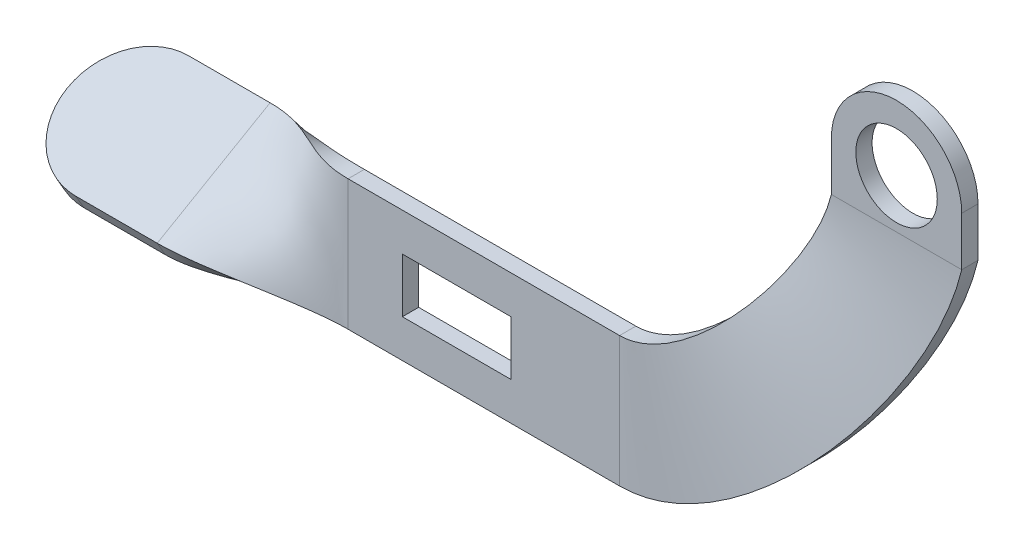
ISO-10303-21;
HEADER;
FILE_DESCRIPTION(('STEP AP214'),'2;1');
FILE_NAME('part.step','',(''),(''),'','','');
FILE_SCHEMA(('AUTOMOTIVE_DESIGN { 1 0 10303 214 1 1 1 1 }'));
ENDSEC;
DATA;
#1=APPLICATION_CONTEXT('core data for automotive mechanical design processes');
#2=APPLICATION_PROTOCOL_DEFINITION('international standard','automotive_design',2000,#1);
#3=PRODUCT_CONTEXT('',#1,'mechanical');
#4=PRODUCT('Part','Part','',(#3));
#5=PRODUCT_RELATED_PRODUCT_CATEGORY('part','',(#4));
#6=PRODUCT_DEFINITION_FORMATION('','',#4);
#7=PRODUCT_DEFINITION_CONTEXT('part definition',#1,'design');
#8=PRODUCT_DEFINITION('design','',#6,#7);
#9=PRODUCT_DEFINITION_SHAPE('','',#8);
#10=(LENGTH_UNIT() NAMED_UNIT(*) SI_UNIT(.MILLI.,.METRE.));
#11=(NAMED_UNIT(*) PLANE_ANGLE_UNIT() SI_UNIT($,.RADIAN.));
#12=(NAMED_UNIT(*) SI_UNIT($,.STERADIAN.) SOLID_ANGLE_UNIT());
#13=UNCERTAINTY_MEASURE_WITH_UNIT(LENGTH_MEASURE(1.E-05),#10,'distance_accuracy_value','');
#14=(GEOMETRIC_REPRESENTATION_CONTEXT(3) GLOBAL_UNCERTAINTY_ASSIGNED_CONTEXT((#13)) GLOBAL_UNIT_ASSIGNED_CONTEXT((#10,
#11,#12)) REPRESENTATION_CONTEXT('',''));
#15=CARTESIAN_POINT('',(0.,0.,0.));
#16=DIRECTION('',(0.,0.,1.));
#17=DIRECTION('',(1.,0.,0.));
#18=AXIS2_PLACEMENT_3D('',#15,#16,#17);
#19=CARTESIAN_POINT('',(0.,24.,3.));
#20=DIRECTION('',(0.,0.,-1.));
#21=DIRECTION('',(-1.,0.,0.));
#22=AXIS2_PLACEMENT_3D('',#19,#20,#21);
#23=PLANE('',#22);
#24=DIRECTION('',(0.,-1.,0.));
#25=VECTOR('',#24,1.);
#26=CARTESIAN_POINT('',(0.,0.,3.));
#27=LINE('',#26,#25);
#28=CARTESIAN_POINT('',(0.,24.,3.));
#29=VERTEX_POINT('',#28);
#30=CARTESIAN_POINT('',(0.,0.,3.));
#31=VERTEX_POINT('',#30);
#32=EDGE_CURVE('E292',#29,#31,#27,.T.);
#33=ORIENTED_EDGE('',*,*,#32,.T.);
#34=DIRECTION('',(1.,0.,0.));
#35=VECTOR('',#34,1.);
#36=CARTESIAN_POINT('',(0.,0.,3.));
#37=LINE('',#36,#35);
#38=CARTESIAN_POINT('',(50.,0.,3.));
#39=VERTEX_POINT('',#38);
#40=EDGE_CURVE('E420',#31,#39,#37,.T.);
#41=ORIENTED_EDGE('',*,*,#40,.T.);
#42=DIRECTION('',(0.,1.,0.));
#43=VECTOR('',#42,1.);
#44=CARTESIAN_POINT('',(50.,0.,3.));
#45=LINE('',#44,#43);
#46=CARTESIAN_POINT('',(50.,24.,3.));
#47=VERTEX_POINT('',#46);
#48=EDGE_CURVE('E423',#39,#47,#45,.T.);
#49=ORIENTED_EDGE('',*,*,#48,.T.);
#50=DIRECTION('',(-1.,0.,0.));
#51=VECTOR('',#50,1.);
#52=CARTESIAN_POINT('',(0.,24.,3.));
#53=LINE('',#52,#51);
#54=EDGE_CURVE('E425',#47,#29,#53,.T.);
#55=ORIENTED_EDGE('',*,*,#54,.T.);
#56=EDGE_LOOP('',(#33,#41,#49,#55));
#57=FACE_BOUND('',#56,.T.);
#58=DIRECTION('',(0.,-1.,0.));
#59=VECTOR('',#58,1.);
#60=CARTESIAN_POINT('',(10.,17.,3.));
#61=LINE('',#60,#59);
#62=CARTESIAN_POINT('',(10.,17.,3.));
#63=VERTEX_POINT('',#62);
#64=CARTESIAN_POINT('',(10.,7.,3.));
#65=VERTEX_POINT('',#64);
#66=EDGE_CURVE('E393',#63,#65,#61,.T.);
#67=ORIENTED_EDGE('',*,*,#66,.F.);
#68=DIRECTION('',(-1.,0.,0.));
#69=VECTOR('',#68,1.);
#70=CARTESIAN_POINT('',(10.,17.,3.));
#71=LINE('',#70,#69);
#72=CARTESIAN_POINT('',(30.,17.,3.));
#73=VERTEX_POINT('',#72);
#74=EDGE_CURVE('E400',#73,#63,#71,.T.);
#75=ORIENTED_EDGE('',*,*,#74,.F.);
#76=DIRECTION('',(0.,1.,0.));
#77=VECTOR('',#76,1.);
#78=CARTESIAN_POINT('',(30.,17.,3.));
#79=LINE('',#78,#77);
#80=CARTESIAN_POINT('',(30.,7.,3.));
#81=VERTEX_POINT('',#80);
#82=EDGE_CURVE('E398',#81,#73,#79,.T.);
#83=ORIENTED_EDGE('',*,*,#82,.F.);
#84=DIRECTION('',(1.,0.,0.));
#85=VECTOR('',#84,1.);
#86=CARTESIAN_POINT('',(10.,7.,3.));
#87=LINE('',#86,#85);
#88=EDGE_CURVE('E395',#65,#81,#87,.T.);
#89=ORIENTED_EDGE('',*,*,#88,.F.);
#90=EDGE_LOOP('',(#67,#75,#83,#89));
#91=FACE_BOUND('',#90,.T.);
#92=ADVANCED_FACE('F139',(#57,#91),#23,.F.);
#93=CARTESIAN_POINT('',(0.,24.,0.));
#94=DIRECTION('',(0.,0.,-1.));
#95=DIRECTION('',(-1.,0.,0.));
#96=AXIS2_PLACEMENT_3D('',#93,#94,#95);
#97=PLANE('',#96);
#98=DIRECTION('',(0.,-1.,0.));
#99=VECTOR('',#98,1.);
#100=CARTESIAN_POINT('',(0.,0.,0.));
#101=LINE('',#100,#99);
#102=CARTESIAN_POINT('',(0.,24.,0.));
#103=VERTEX_POINT('',#102);
#104=CARTESIAN_POINT('',(0.,0.,0.));
#105=VERTEX_POINT('',#104);
#106=EDGE_CURVE('E418',#103,#105,#101,.T.);
#107=ORIENTED_EDGE('',*,*,#106,.F.);
#108=DIRECTION('',(-1.,0.,0.));
#109=VECTOR('',#108,1.);
#110=CARTESIAN_POINT('',(0.,24.,0.));
#111=LINE('',#110,#109);
#112=CARTESIAN_POINT('',(50.,24.,0.));
#113=VERTEX_POINT('',#112);
#114=EDGE_CURVE('E421',#113,#103,#111,.T.);
#115=ORIENTED_EDGE('',*,*,#114,.F.);
#116=DIRECTION('',(0.,1.,0.));
#117=VECTOR('',#116,1.);
#118=CARTESIAN_POINT('',(50.,0.,0.));
#119=LINE('',#118,#117);
#120=CARTESIAN_POINT('',(50.,0.,0.));
#121=VERTEX_POINT('',#120);
#122=EDGE_CURVE('E433',#121,#113,#119,.T.);
#123=ORIENTED_EDGE('',*,*,#122,.F.);
#124=DIRECTION('',(1.,0.,0.));
#125=VECTOR('',#124,1.);
#126=CARTESIAN_POINT('',(0.,0.,0.));
#127=LINE('',#126,#125);
#128=EDGE_CURVE('E430',#105,#121,#127,.T.);
#129=ORIENTED_EDGE('',*,*,#128,.F.);
#130=EDGE_LOOP('',(#107,#115,#123,#129));
#131=FACE_BOUND('',#130,.T.);
#132=DIRECTION('',(-1.,0.,0.));
#133=VECTOR('',#132,1.);
#134=CARTESIAN_POINT('',(10.,17.,0.));
#135=LINE('',#134,#133);
#136=CARTESIAN_POINT('',(30.,17.,0.));
#137=VERTEX_POINT('',#136);
#138=CARTESIAN_POINT('',(10.,17.,0.));
#139=VERTEX_POINT('',#138);
#140=EDGE_CURVE('E396',#137,#139,#135,.T.);
#141=ORIENTED_EDGE('',*,*,#140,.T.);
#142=DIRECTION('',(0.,-1.,0.));
#143=VECTOR('',#142,1.);
#144=CARTESIAN_POINT('',(10.,17.,0.));
#145=LINE('',#144,#143);
#146=CARTESIAN_POINT('',(10.,7.,0.));
#147=VERTEX_POINT('',#146);
#148=EDGE_CURVE('E162',#139,#147,#145,.T.);
#149=ORIENTED_EDGE('',*,*,#148,.T.);
#150=DIRECTION('',(1.,0.,0.));
#151=VECTOR('',#150,1.);
#152=CARTESIAN_POINT('',(10.,7.,0.));
#153=LINE('',#152,#151);
#154=CARTESIAN_POINT('',(30.,7.,0.));
#155=VERTEX_POINT('',#154);
#156=EDGE_CURVE('E404',#147,#155,#153,.T.);
#157=ORIENTED_EDGE('',*,*,#156,.T.);
#158=DIRECTION('',(0.,1.,0.));
#159=VECTOR('',#158,1.);
#160=CARTESIAN_POINT('',(30.,17.,0.));
#161=LINE('',#160,#159);
#162=EDGE_CURVE('E407',#155,#137,#161,.T.);
#163=ORIENTED_EDGE('',*,*,#162,.T.);
#164=EDGE_LOOP('',(#141,#149,#157,#163));
#165=FACE_BOUND('',#164,.T.);
#166=ADVANCED_FACE('F486',(#131,#165),#97,.T.);
#167=CARTESIAN_POINT('',(0.,0.,3.));
#168=DIRECTION('',(0.,1.,0.));
#169=DIRECTION('',(0.,0.,1.));
#170=AXIS2_PLACEMENT_3D('',#167,#168,#169);
#171=PLANE('',#170);
#172=ORIENTED_EDGE('',*,*,#128,.T.);
#173=DIRECTION('',(0.,0.,-1.));
#174=VECTOR('',#173,1.);
#175=CARTESIAN_POINT('',(50.,0.,3.));
#176=LINE('',#175,#174);
#177=EDGE_CURVE('E147',#39,#121,#176,.T.);
#178=ORIENTED_EDGE('',*,*,#177,.F.);
#179=ORIENTED_EDGE('',*,*,#40,.F.);
#180=DIRECTION('',(0.,0.,-1.));
#181=VECTOR('',#180,1.);
#182=CARTESIAN_POINT('',(0.,0.,3.));
#183=LINE('',#182,#181);
#184=EDGE_CURVE('E12',#31,#105,#183,.T.);
#185=ORIENTED_EDGE('',*,*,#184,.T.);
#186=EDGE_LOOP('',(#172,#178,#179,#185));
#187=FACE_BOUND('',#186,.T.);
#188=ADVANCED_FACE('F141',(#187),#171,.F.);
#189=CARTESIAN_POINT('',(0.,24.,3.));
#190=DIRECTION('',(0.,-1.,0.));
#191=DIRECTION('',(0.,0.,-1.));
#192=AXIS2_PLACEMENT_3D('',#189,#190,#191);
#193=PLANE('',#192);
#194=ORIENTED_EDGE('',*,*,#114,.T.);
#195=DIRECTION('',(0.,0.,-1.));
#196=VECTOR('',#195,1.);
#197=CARTESIAN_POINT('',(0.,24.,3.));
#198=LINE('',#197,#196);
#199=EDGE_CURVE('E427',#29,#103,#198,.T.);
#200=ORIENTED_EDGE('',*,*,#199,.F.);
#201=ORIENTED_EDGE('',*,*,#54,.F.);
#202=DIRECTION('',(0.,0.,-1.));
#203=VECTOR('',#202,1.);
#204=CARTESIAN_POINT('',(50.,24.,3.));
#205=LINE('',#204,#203);
#206=EDGE_CURVE('E439',#47,#113,#205,.T.);
#207=ORIENTED_EDGE('',*,*,#206,.T.);
#208=EDGE_LOOP('',(#194,#200,#201,#207));
#209=FACE_BOUND('',#208,.T.);
#210=ADVANCED_FACE('F498',(#209),#193,.F.);
#211=CARTESIAN_POINT('',(10.,17.,3.));
#212=DIRECTION('',(1.,0.,0.));
#213=DIRECTION('',(0.,0.,-1.));
#214=AXIS2_PLACEMENT_3D('',#211,#212,#213);
#215=PLANE('',#214);
#216=ORIENTED_EDGE('',*,*,#148,.F.);
#217=DIRECTION('',(0.,0.,-1.));
#218=VECTOR('',#217,1.);
#219=CARTESIAN_POINT('',(10.,17.,3.));
#220=LINE('',#219,#218);
#221=EDGE_CURVE('E402',#63,#139,#220,.T.);
#222=ORIENTED_EDGE('',*,*,#221,.F.);
#223=ORIENTED_EDGE('',*,*,#66,.T.);
#224=DIRECTION('',(0.,0.,-1.));
#225=VECTOR('',#224,1.);
#226=CARTESIAN_POINT('',(10.,7.,3.));
#227=LINE('',#226,#225);
#228=EDGE_CURVE('E416',#65,#147,#227,.T.);
#229=ORIENTED_EDGE('',*,*,#228,.T.);
#230=EDGE_LOOP('',(#216,#222,#223,#229));
#231=FACE_BOUND('',#230,.T.);
#232=ADVANCED_FACE('F496',(#231),#215,.T.);
#233=CARTESIAN_POINT('',(10.,7.,3.));
#234=DIRECTION('',(0.,1.,0.));
#235=DIRECTION('',(0.,0.,1.));
#236=AXIS2_PLACEMENT_3D('',#233,#234,#235);
#237=PLANE('',#236);
#238=ORIENTED_EDGE('',*,*,#156,.F.);
#239=ORIENTED_EDGE('',*,*,#228,.F.);
#240=ORIENTED_EDGE('',*,*,#88,.T.);
#241=DIRECTION('',(0.,0.,-1.));
#242=VECTOR('',#241,1.);
#243=CARTESIAN_POINT('',(30.,7.,3.));
#244=LINE('',#243,#242);
#245=EDGE_CURVE('E414',#81,#155,#244,.T.);
#246=ORIENTED_EDGE('',*,*,#245,.T.);
#247=EDGE_LOOP('',(#238,#239,#240,#246));
#248=FACE_BOUND('',#247,.T.);
#249=ADVANCED_FACE('F505',(#248),#237,.T.);
#250=CARTESIAN_POINT('',(30.,17.,3.));
#251=DIRECTION('',(-1.,0.,0.));
#252=DIRECTION('',(0.,0.,1.));
#253=AXIS2_PLACEMENT_3D('',#250,#251,#252);
#254=PLANE('',#253);
#255=ORIENTED_EDGE('',*,*,#162,.F.);
#256=ORIENTED_EDGE('',*,*,#245,.F.);
#257=ORIENTED_EDGE('',*,*,#82,.T.);
#258=DIRECTION('',(0.,0.,-1.));
#259=VECTOR('',#258,1.);
#260=CARTESIAN_POINT('',(30.,17.,3.));
#261=LINE('',#260,#259);
#262=EDGE_CURVE('E154',#73,#137,#261,.T.);
#263=ORIENTED_EDGE('',*,*,#262,.T.);
#264=EDGE_LOOP('',(#255,#256,#257,#263));
#265=FACE_BOUND('',#264,.T.);
#266=ADVANCED_FACE('F544',(#265),#254,.T.);
#267=CARTESIAN_POINT('',(10.,17.,3.));
#268=DIRECTION('',(0.,-1.,0.));
#269=DIRECTION('',(0.,0.,-1.));
#270=AXIS2_PLACEMENT_3D('',#267,#268,#269);
#271=PLANE('',#270);
#272=ORIENTED_EDGE('',*,*,#140,.F.);
#273=ORIENTED_EDGE('',*,*,#262,.F.);
#274=ORIENTED_EDGE('',*,*,#74,.T.);
#275=ORIENTED_EDGE('',*,*,#221,.T.);
#276=EDGE_LOOP('',(#272,#273,#274,#275));
#277=FACE_BOUND('',#276,.T.);
#278=ADVANCED_FACE('F535',(#277),#271,.T.);
#279=CARTESIAN_POINT('',(79.,56.,-10.));
#280=CARTESIAN_POINT('',(75.8125972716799,42.4651832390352,-10.));
#281=CARTESIAN_POINT('',(62.7323307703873,24.,0.));
#282=CARTESIAN_POINT('',(50.,24.,0.));
#283=CARTESIAN_POINT('',(81.,56.,-10.));
#284=CARTESIAN_POINT('',(77.6125411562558,41.615675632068,-10.));
#285=CARTESIAN_POINT('',(63.5510503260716,22.,0.));
#286=CARTESIAN_POINT('',(50.,22.,0.));
#287=CARTESIAN_POINT('',(85.0000000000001,56.,-10.));
#288=CARTESIAN_POINT('',(81.2124289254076,39.9166604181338,-10.));
#289=CARTESIAN_POINT('',(65.1884894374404,18.,0.));
#290=CARTESIAN_POINT('',(50.,18.,0.));
#291=CARTESIAN_POINT('',(90.9999999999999,56.,-9.99999999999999));
#292=CARTESIAN_POINT('',(86.6089116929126,37.3539170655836,-9.99999999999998));
#293=CARTESIAN_POINT('',(67.659257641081,12.,0.));
#294=CARTESIAN_POINT('',(50.,12.,0.));
#295=CARTESIAN_POINT('',(97.0000000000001,56.,-10.));
#296=CARTESIAN_POINT('',(92.0042255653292,34.7862101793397,-10.));
#297=CARTESIAN_POINT('',(70.135125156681,5.99999999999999,0.));
#298=CARTESIAN_POINT('',(50.,5.99999999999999,0.));
#299=CARTESIAN_POINT('',(101.,56.,-10.));
#300=CARTESIAN_POINT('',(95.6002466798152,33.0707758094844,-10.));
#301=CARTESIAN_POINT('',(71.7894325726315,2.,0.));
#302=CARTESIAN_POINT('',(50.,2.,0.));
#303=CARTESIAN_POINT('',(103.,56.,-10.));
#304=CARTESIAN_POINT('',(97.3982572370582,32.2130586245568,-10.));
#305=CARTESIAN_POINT('',(72.6165862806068,0.,0.));
#306=CARTESIAN_POINT('',(50.,0.,0.));
#307=B_SPLINE_SURFACE_WITH_KNOTS('',3,3,((#279,#280,#281,#282),(#283,#284,#285,#286),(#287,#288,
#289,#290),(#291,#292,#293,#294),(#295,#296,#297,#298),(#299,#300,#301,#302),(#303,#304,#305,
#306)),.UNSPECIFIED.,.F.,.F.,.F.,(4,1,1,1,4),(4,4),(0.,0.25,0.5,0.75,1.),(0.,1.),.UNSPECIFIED.);
#308=DIRECTION('',(1.,0.,0.));
#309=VECTOR('',#308,1.);
#310=CARTESIAN_POINT('',(90.9999999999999,56.,-9.99999999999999));
#311=LINE('',#310,#309);
#312=CARTESIAN_POINT('',(79.,56.,-10.));
#313=VERTEX_POINT('',#312);
#314=CARTESIAN_POINT('',(103.,56.,-10.));
#315=VERTEX_POINT('',#314);
#316=EDGE_CURVE('E363',#313,#315,#311,.T.);
#317=CARTESIAN_POINT('',(103.,56.,-10.));
#318=CARTESIAN_POINT('',(97.3982572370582,32.2130586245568,-10.));
#319=CARTESIAN_POINT('',(72.6165862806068,0.,0.));
#320=CARTESIAN_POINT('',(50.,0.,0.));
#321=B_SPLINE_CURVE_WITH_KNOTS('',3,(#317,#318,#319,#320),.UNSPECIFIED.,.F.,.F.,(4,4),(0.,1.),.UNSPECIFIED.);
#322=EDGE_CURVE('E355',#315,#121,#321,.T.);
#323=CARTESIAN_POINT('',(79.,56.,-10.));
#324=CARTESIAN_POINT('',(75.8125972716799,42.4651832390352,-10.));
#325=CARTESIAN_POINT('',(62.7323307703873,24.,0.));
#326=CARTESIAN_POINT('',(50.,24.,0.));
#327=B_SPLINE_CURVE_WITH_KNOTS('',3,(#323,#324,#325,#326),.UNSPECIFIED.,.F.,.F.,(4,4),(0.,1.),.UNSPECIFIED.);
#328=EDGE_CURVE('E349',#313,#113,#327,.T.);
#329=ORIENTED_EDGE('',*,*,#316,.T.);
#330=ORIENTED_EDGE('',*,*,#322,.T.);
#331=ORIENTED_EDGE('',*,*,#122,.T.);
#332=ORIENTED_EDGE('',*,*,#328,.F.);
#333=EDGE_LOOP('',(#329,#330,#331,#332));
#334=FACE_BOUND('',#333,.T.);
#335=ADVANCED_FACE('F449',(#334),#307,.T.);
#336=CARTESIAN_POINT('',(103.,56.,-10.));
#337=CARTESIAN_POINT('',(97.3982572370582,32.2130586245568,-10.));
#338=CARTESIAN_POINT('',(72.6165862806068,0.,0.));
#339=CARTESIAN_POINT('',(50.,0.,0.));
#340=CARTESIAN_POINT('',(103.,56.,-9.75));
#341=CARTESIAN_POINT('',(97.3982572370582,32.2130586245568,-9.75));
#342=CARTESIAN_POINT('',(72.6165862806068,0.,0.25));
#343=CARTESIAN_POINT('',(50.,0.,0.25));
#344=CARTESIAN_POINT('',(103.,56.,-9.25000000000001));
#345=CARTESIAN_POINT('',(97.3982572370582,32.2130586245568,-9.25000000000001));
#346=CARTESIAN_POINT('',(72.6165862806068,0.,0.749999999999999));
#347=CARTESIAN_POINT('',(50.,0.,0.75));
#348=CARTESIAN_POINT('',(103.,56.,-8.49999999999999));
#349=CARTESIAN_POINT('',(97.3982572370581,32.2130586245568,-8.49999999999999));
#350=CARTESIAN_POINT('',(72.6165862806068,0.,1.5));
#351=CARTESIAN_POINT('',(50.,0.,1.5));
#352=CARTESIAN_POINT('',(103.,56.,-7.75000000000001));
#353=CARTESIAN_POINT('',(97.3982572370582,32.2130586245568,-7.75000000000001));
#354=CARTESIAN_POINT('',(72.6165862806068,0.,2.25));
#355=CARTESIAN_POINT('',(50.,0.,2.25));
#356=CARTESIAN_POINT('',(103.,56.,-7.25));
#357=CARTESIAN_POINT('',(97.3982572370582,32.2130586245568,-7.25));
#358=CARTESIAN_POINT('',(72.6165862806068,0.,2.75));
#359=CARTESIAN_POINT('',(50.,0.,2.75));
#360=CARTESIAN_POINT('',(103.,56.,-7.));
#361=CARTESIAN_POINT('',(97.3982572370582,32.2130586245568,-7.));
#362=CARTESIAN_POINT('',(72.6165862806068,0.,3.));
#363=CARTESIAN_POINT('',(50.,0.,3.));
#364=B_SPLINE_SURFACE_WITH_KNOTS('',3,3,((#336,#337,#338,#339),(#340,#341,#342,#343),(#344,#345,
#346,#347),(#348,#349,#350,#351),(#352,#353,#354,#355),(#356,#357,#358,#359),(#360,#361,#362,
#363)),.UNSPECIFIED.,.F.,.F.,.F.,(4,1,1,1,4),(4,4),(0.,0.25,0.5,0.75,1.),(0.,1.),.UNSPECIFIED.);
#365=DIRECTION('',(0.,0.,1.));
#366=VECTOR('',#365,1.);
#367=CARTESIAN_POINT('',(103.,56.,-8.5));
#368=LINE('',#367,#366);
#369=CARTESIAN_POINT('',(103.,56.,-7.));
#370=VERTEX_POINT('',#369);
#371=EDGE_CURVE('E364',#315,#370,#368,.T.);
#372=CARTESIAN_POINT('',(103.,56.,-7.));
#373=CARTESIAN_POINT('',(97.3982572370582,32.2130586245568,-7.));
#374=CARTESIAN_POINT('',(72.6165862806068,0.,3.));
#375=CARTESIAN_POINT('',(50.,0.,3.));
#376=B_SPLINE_CURVE_WITH_KNOTS('',3,(#372,#373,#374,#375),.UNSPECIFIED.,.F.,.F.,(4,4),(0.,1.),.UNSPECIFIED.);
#377=EDGE_CURVE('E365',#370,#39,#376,.T.);
#378=ORIENTED_EDGE('',*,*,#371,.T.);
#379=ORIENTED_EDGE('',*,*,#377,.T.);
#380=ORIENTED_EDGE('',*,*,#177,.T.);
#381=ORIENTED_EDGE('',*,*,#322,.F.);
#382=EDGE_LOOP('',(#378,#379,#380,#381));
#383=FACE_BOUND('',#382,.T.);
#384=ADVANCED_FACE('F444',(#383),#364,.T.);
#385=CARTESIAN_POINT('',(103.,56.,-7.));
#386=CARTESIAN_POINT('',(97.3982572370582,32.2130586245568,-7.));
#387=CARTESIAN_POINT('',(72.6165862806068,0.,3.));
#388=CARTESIAN_POINT('',(50.,0.,3.));
#389=CARTESIAN_POINT('',(101.,56.,-7.));
#390=CARTESIAN_POINT('',(95.6002466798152,33.0707758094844,-7.));
#391=CARTESIAN_POINT('',(71.7894325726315,2.,3.));
#392=CARTESIAN_POINT('',(50.,2.,3.));
#393=CARTESIAN_POINT('',(97.0000000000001,56.,-7.));
#394=CARTESIAN_POINT('',(92.0042255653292,34.7862101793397,-7.));
#395=CARTESIAN_POINT('',(70.135125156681,6.,3.));
#396=CARTESIAN_POINT('',(50.,6.,3.));
#397=CARTESIAN_POINT('',(90.9999999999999,56.,-7.));
#398=CARTESIAN_POINT('',(86.6089116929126,37.3539170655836,-7.));
#399=CARTESIAN_POINT('',(67.659257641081,12.,3.));
#400=CARTESIAN_POINT('',(50.,12.,3.));
#401=CARTESIAN_POINT('',(85.,56.,-7.));
#402=CARTESIAN_POINT('',(81.2124289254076,39.9166604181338,-7.));
#403=CARTESIAN_POINT('',(65.1884894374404,18.,3.));
#404=CARTESIAN_POINT('',(50.,18.,3.));
#405=CARTESIAN_POINT('',(81.,56.,-7.));
#406=CARTESIAN_POINT('',(77.6125411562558,41.615675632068,-7.));
#407=CARTESIAN_POINT('',(63.5510503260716,22.,3.));
#408=CARTESIAN_POINT('',(50.,22.,3.));
#409=CARTESIAN_POINT('',(79.,56.,-7.));
#410=CARTESIAN_POINT('',(75.8125972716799,42.4651832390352,-7.));
#411=CARTESIAN_POINT('',(62.7323307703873,24.,3.));
#412=CARTESIAN_POINT('',(50.,24.,3.));
#413=B_SPLINE_SURFACE_WITH_KNOTS('',3,3,((#385,#386,#387,#388),(#389,#390,#391,#392),(#393,#394,
#395,#396),(#397,#398,#399,#400),(#401,#402,#403,#404),(#405,#406,#407,#408),(#409,#410,#411,
#412)),.UNSPECIFIED.,.F.,.F.,.F.,(4,1,1,1,4),(4,4),(0.,0.25,0.5,0.75,1.),(0.,1.),.UNSPECIFIED.);
#414=DIRECTION('',(-1.,0.,0.));
#415=VECTOR('',#414,1.);
#416=CARTESIAN_POINT('',(90.9999999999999,56.,-7.));
#417=LINE('',#416,#415);
#418=CARTESIAN_POINT('',(79.,56.,-7.));
#419=VERTEX_POINT('',#418);
#420=EDGE_CURVE('E373',#370,#419,#417,.T.);
#421=CARTESIAN_POINT('',(79.,56.,-7.));
#422=CARTESIAN_POINT('',(75.8125972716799,42.4651832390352,-7.));
#423=CARTESIAN_POINT('',(62.7323307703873,24.,3.));
#424=CARTESIAN_POINT('',(50.,24.,3.));
#425=B_SPLINE_CURVE_WITH_KNOTS('',3,(#421,#422,#423,#424),.UNSPECIFIED.,.F.,.F.,(4,4),(0.,1.),.UNSPECIFIED.);
#426=EDGE_CURVE('E374',#419,#47,#425,.T.);
#427=ORIENTED_EDGE('',*,*,#420,.T.);
#428=ORIENTED_EDGE('',*,*,#426,.T.);
#429=ORIENTED_EDGE('',*,*,#48,.F.);
#430=ORIENTED_EDGE('',*,*,#377,.F.);
#431=EDGE_LOOP('',(#427,#428,#429,#430));
#432=FACE_BOUND('',#431,.T.);
#433=ADVANCED_FACE('F465',(#432),#413,.T.);
#434=CARTESIAN_POINT('',(79.,56.,-7.));
#435=CARTESIAN_POINT('',(75.8125972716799,42.4651832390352,-7.));
#436=CARTESIAN_POINT('',(62.7323307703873,24.,3.));
#437=CARTESIAN_POINT('',(50.,24.,3.));
#438=CARTESIAN_POINT('',(79.,56.,-7.25));
#439=CARTESIAN_POINT('',(75.8125972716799,42.4651832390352,-7.25));
#440=CARTESIAN_POINT('',(62.7323307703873,24.,2.75));
#441=CARTESIAN_POINT('',(50.,24.,2.75));
#442=CARTESIAN_POINT('',(79.,56.,-7.75));
#443=CARTESIAN_POINT('',(75.8125972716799,42.4651832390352,-7.75));
#444=CARTESIAN_POINT('',(62.7323307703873,24.,2.25));
#445=CARTESIAN_POINT('',(50.,24.,2.25));
#446=CARTESIAN_POINT('',(78.9999999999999,56.,-8.50000000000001));
#447=CARTESIAN_POINT('',(75.8125972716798,42.4651832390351,-8.5));
#448=CARTESIAN_POINT('',(62.7323307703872,24.,1.5));
#449=CARTESIAN_POINT('',(50.,24.,1.5));
#450=CARTESIAN_POINT('',(79.,56.,-9.24999999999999));
#451=CARTESIAN_POINT('',(75.8125972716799,42.4651832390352,-9.24999999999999));
#452=CARTESIAN_POINT('',(62.7323307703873,24.,0.749999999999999));
#453=CARTESIAN_POINT('',(50.,24.,0.749999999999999));
#454=CARTESIAN_POINT('',(79.,56.,-9.75));
#455=CARTESIAN_POINT('',(75.8125972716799,42.4651832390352,-9.75));
#456=CARTESIAN_POINT('',(62.7323307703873,24.,0.25));
#457=CARTESIAN_POINT('',(50.,24.,0.25));
#458=CARTESIAN_POINT('',(79.,56.,-10.));
#459=CARTESIAN_POINT('',(75.8125972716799,42.4651832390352,-10.));
#460=CARTESIAN_POINT('',(62.7323307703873,24.,0.));
#461=CARTESIAN_POINT('',(50.,24.,0.));
#462=B_SPLINE_SURFACE_WITH_KNOTS('',3,3,((#434,#435,#436,#437),(#438,#439,#440,#441),(#442,#443,
#444,#445),(#446,#447,#448,#449),(#450,#451,#452,#453),(#454,#455,#456,#457),(#458,#459,#460,
#461)),.UNSPECIFIED.,.F.,.F.,.F.,(4,1,1,1,4),(4,4),(0.,0.25,0.5,0.75,1.),(0.,1.),.UNSPECIFIED.);
#463=DIRECTION('',(0.,0.,-1.));
#464=VECTOR('',#463,1.);
#465=CARTESIAN_POINT('',(79.,56.,-8.5));
#466=LINE('',#465,#464);
#467=EDGE_CURVE('E354',#419,#313,#466,.T.);
#468=ORIENTED_EDGE('',*,*,#467,.T.);
#469=ORIENTED_EDGE('',*,*,#328,.T.);
#470=ORIENTED_EDGE('',*,*,#206,.F.);
#471=ORIENTED_EDGE('',*,*,#426,.F.);
#472=EDGE_LOOP('',(#468,#469,#470,#471));
#473=FACE_BOUND('',#472,.T.);
#474=ADVANCED_FACE('F462',(#473),#462,.T.);
#475=CARTESIAN_POINT('',(91.,65.,-7.));
#476=DIRECTION('',(0.,0.,1.));
#477=DIRECTION('',(1.,0.,0.));
#478=AXIS2_PLACEMENT_3D('',#475,#476,#477);
#479=PLANE('',#478);
#480=CARTESIAN_POINT('',(91.,65.,-7.));
#481=DIRECTION('',(0.,0.,1.));
#482=DIRECTION('',(1.,0.,0.));
#483=AXIS2_PLACEMENT_3D('',#480,#481,#482);
#484=CIRCLE('',#483,12.);
#485=CARTESIAN_POINT('',(103.,65.,-7.));
#486=VERTEX_POINT('',#485);
#487=CARTESIAN_POINT('',(79.,65.,-7.));
#488=VERTEX_POINT('',#487);
#489=EDGE_CURVE('E329',#486,#488,#484,.T.);
#490=ORIENTED_EDGE('',*,*,#489,.T.);
#491=DIRECTION('',(0.,-1.,0.));
#492=VECTOR('',#491,1.);
#493=CARTESIAN_POINT('',(79.,56.,-7.));
#494=LINE('',#493,#492);
#495=EDGE_CURVE('E332',#488,#419,#494,.T.);
#496=ORIENTED_EDGE('',*,*,#495,.T.);
#497=ORIENTED_EDGE('',*,*,#420,.F.);
#498=DIRECTION('',(0.,1.,0.));
#499=VECTOR('',#498,1.);
#500=CARTESIAN_POINT('',(103.,65.,-7.));
#501=LINE('',#500,#499);
#502=EDGE_CURVE('E335',#370,#486,#501,.T.);
#503=ORIENTED_EDGE('',*,*,#502,.T.);
#504=EDGE_LOOP('',(#490,#496,#497,#503));
#505=FACE_BOUND('',#504,.T.);
#506=CARTESIAN_POINT('',(91.,65.,-7.));
#507=DIRECTION('',(0.,0.,1.));
#508=DIRECTION('',(1.,0.,0.));
#509=AXIS2_PLACEMENT_3D('',#506,#507,#508);
#510=CIRCLE('',#509,7.5);
#511=CARTESIAN_POINT('',(98.5,65.,-7.));
#512=VERTEX_POINT('',#511);
#513=EDGE_CURVE('E323',#512,#512,#510,.T.);
#514=ORIENTED_EDGE('',*,*,#513,.F.);
#515=EDGE_LOOP('',(#514));
#516=FACE_BOUND('',#515,.T.);
#517=ADVANCED_FACE('F468',(#505,#516),#479,.T.);
#518=CARTESIAN_POINT('',(91.,65.,-10.));
#519=DIRECTION('',(0.,0.,1.));
#520=DIRECTION('',(1.,0.,0.));
#521=AXIS2_PLACEMENT_3D('',#518,#519,#520);
#522=PLANE('',#521);
#523=CARTESIAN_POINT('',(91.,65.,-10.));
#524=DIRECTION('',(0.,0.,1.));
#525=DIRECTION('',(1.,0.,0.));
#526=AXIS2_PLACEMENT_3D('',#523,#524,#525);
#527=CIRCLE('',#526,12.);
#528=CARTESIAN_POINT('',(103.,65.,-10.));
#529=VERTEX_POINT('',#528);
#530=CARTESIAN_POINT('',(79.,65.,-10.));
#531=VERTEX_POINT('',#530);
#532=EDGE_CURVE('E326',#529,#531,#527,.T.);
#533=ORIENTED_EDGE('',*,*,#532,.F.);
#534=DIRECTION('',(0.,1.,0.));
#535=VECTOR('',#534,1.);
#536=CARTESIAN_POINT('',(103.,65.,-10.));
#537=LINE('',#536,#535);
#538=EDGE_CURVE('E333',#315,#529,#537,.T.);
#539=ORIENTED_EDGE('',*,*,#538,.F.);
#540=ORIENTED_EDGE('',*,*,#316,.F.);
#541=DIRECTION('',(0.,-1.,0.));
#542=VECTOR('',#541,1.);
#543=CARTESIAN_POINT('',(79.,56.,-10.));
#544=LINE('',#543,#542);
#545=EDGE_CURVE('E340',#531,#313,#544,.T.);
#546=ORIENTED_EDGE('',*,*,#545,.F.);
#547=EDGE_LOOP('',(#533,#539,#540,#546));
#548=FACE_BOUND('',#547,.T.);
#549=CARTESIAN_POINT('',(91.,65.,-10.));
#550=DIRECTION('',(0.,0.,1.));
#551=DIRECTION('',(1.,0.,0.));
#552=AXIS2_PLACEMENT_3D('',#549,#550,#551);
#553=CIRCLE('',#552,7.5);
#554=CARTESIAN_POINT('',(98.5,65.,-10.));
#555=VERTEX_POINT('',#554);
#556=EDGE_CURVE('E287',#555,#555,#553,.T.);
#557=ORIENTED_EDGE('',*,*,#556,.T.);
#558=EDGE_LOOP('',(#557));
#559=FACE_BOUND('',#558,.T.);
#560=ADVANCED_FACE('F454',(#548,#559),#522,.F.);
#561=CARTESIAN_POINT('',(91.,65.,-7.));
#562=DIRECTION('',(0.,0.,-1.));
#563=DIRECTION('',(-1.,0.,0.));
#564=AXIS2_PLACEMENT_3D('',#561,#562,#563);
#565=CYLINDRICAL_SURFACE('',#564,12.);
#566=ORIENTED_EDGE('',*,*,#532,.T.);
#567=DIRECTION('',(0.,0.,-1.));
#568=VECTOR('',#567,1.);
#569=CARTESIAN_POINT('',(79.,65.,-7.));
#570=LINE('',#569,#568);
#571=EDGE_CURVE('E346',#488,#531,#570,.T.);
#572=ORIENTED_EDGE('',*,*,#571,.F.);
#573=ORIENTED_EDGE('',*,*,#489,.F.);
#574=DIRECTION('',(0.,0.,-1.));
#575=VECTOR('',#574,1.);
#576=CARTESIAN_POINT('',(103.,65.,-7.));
#577=LINE('',#576,#575);
#578=EDGE_CURVE('E337',#486,#529,#577,.T.);
#579=ORIENTED_EDGE('',*,*,#578,.T.);
#580=EDGE_LOOP('',(#566,#572,#573,#579));
#581=FACE_BOUND('',#580,.T.);
#582=ADVANCED_FACE('F475',(#581),#565,.T.);
#583=CARTESIAN_POINT('',(79.,56.,-7.));
#584=DIRECTION('',(1.,0.,0.));
#585=DIRECTION('',(0.,1.,0.));
#586=AXIS2_PLACEMENT_3D('',#583,#584,#585);
#587=PLANE('',#586);
#588=ORIENTED_EDGE('',*,*,#545,.T.);
#589=ORIENTED_EDGE('',*,*,#467,.F.);
#590=ORIENTED_EDGE('',*,*,#495,.F.);
#591=ORIENTED_EDGE('',*,*,#571,.T.);
#592=EDGE_LOOP('',(#588,#589,#590,#591));
#593=FACE_BOUND('',#592,.T.);
#594=ADVANCED_FACE('F458',(#593),#587,.F.);
#595=CARTESIAN_POINT('',(103.,65.,-7.));
#596=DIRECTION('',(-1.,0.,0.));
#597=DIRECTION('',(0.,0.,1.));
#598=AXIS2_PLACEMENT_3D('',#595,#596,#597);
#599=PLANE('',#598);
#600=ORIENTED_EDGE('',*,*,#538,.T.);
#601=ORIENTED_EDGE('',*,*,#578,.F.);
#602=ORIENTED_EDGE('',*,*,#502,.F.);
#603=ORIENTED_EDGE('',*,*,#371,.F.);
#604=EDGE_LOOP('',(#600,#601,#602,#603));
#605=FACE_BOUND('',#604,.T.);
#606=ADVANCED_FACE('F472',(#605),#599,.F.);
#607=CARTESIAN_POINT('',(91.,65.,-7.));
#608=DIRECTION('',(0.,0.,-1.));
#609=DIRECTION('',(-1.,0.,0.));
#610=AXIS2_PLACEMENT_3D('',#607,#608,#609);
#611=CYLINDRICAL_SURFACE('',#610,7.5);
#612=ORIENTED_EDGE('',*,*,#513,.T.);
#613=EDGE_LOOP('',(#612));
#614=FACE_BOUND('',#613,.T.);
#615=ORIENTED_EDGE('',*,*,#556,.F.);
#616=EDGE_LOOP('',(#615));
#617=FACE_BOUND('',#616,.T.);
#618=ADVANCED_FACE('F632',(#614,#617),#611,.F.);
#619=CARTESIAN_POINT('',(-24.,16.7009618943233,-8.14230484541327));
#620=CARTESIAN_POINT('',(-15.5252560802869,16.7009618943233,-8.14230484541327));
#621=CARTESIAN_POINT('',(-8.47474391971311,24.,0.));
#622=CARTESIAN_POINT('',(0.,24.,0.));
#623=CARTESIAN_POINT('',(-24.,16.9174682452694,-8.01730484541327));
#624=CARTESIAN_POINT('',(-15.5291183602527,16.9174682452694,-8.01730484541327));
#625=CARTESIAN_POINT('',(-8.47088163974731,24.,0.25));
#626=CARTESIAN_POINT('',(0.,24.,0.25));
#627=CARTESIAN_POINT('',(-24.,17.3504809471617,-7.76730484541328));
#628=CARTESIAN_POINT('',(-15.5368429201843,17.3504809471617,-7.76730484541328));
#629=CARTESIAN_POINT('',(-8.4631570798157,24.,0.749999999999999));
#630=CARTESIAN_POINT('',(0.,24.,0.75));
#631=CARTESIAN_POINT('',(-24.,18.,-7.39230484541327));
#632=CARTESIAN_POINT('',(-15.5429576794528,18.,-7.39230484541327));
#633=CARTESIAN_POINT('',(-8.4570423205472,24.,1.5));
#634=CARTESIAN_POINT('',(0.,24.,1.5));
#635=CARTESIAN_POINT('',(-24.,18.6495190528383,-7.01730484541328));
#636=CARTESIAN_POINT('',(-15.5454035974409,18.6495190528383,-7.01730484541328));
#637=CARTESIAN_POINT('',(-8.45459640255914,24.,2.25));
#638=CARTESIAN_POINT('',(0.,24.,2.25));
#639=CARTESIAN_POINT('',(-24.,19.0825317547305,-6.76730484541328));
#640=CARTESIAN_POINT('',(-15.5433653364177,19.0825317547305,-6.76730484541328));
#641=CARTESIAN_POINT('',(-8.45663466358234,24.,2.75));
#642=CARTESIAN_POINT('',(0.,24.,2.75));
#643=CARTESIAN_POINT('',(-24.,19.2990381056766,-6.64230484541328));
#644=CARTESIAN_POINT('',(-15.5423462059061,19.2990381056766,-6.64230484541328));
#645=CARTESIAN_POINT('',(-8.45765379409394,24.,3.));
#646=CARTESIAN_POINT('',(0.,24.,3.));
#647=B_SPLINE_SURFACE_WITH_KNOTS('',3,3,((#619,#620,#621,#622),(#623,#624,#625,#626),(#627,#628,
#629,#630),(#631,#632,#633,#634),(#635,#636,#637,#638),(#639,#640,#641,#642),(#643,#644,#645,
#646)),.UNSPECIFIED.,.F.,.F.,.F.,(4,1,1,1,4),(4,4),(0.,0.25,0.5,0.75,1.),(0.,1.),.UNSPECIFIED.);
#648=DIRECTION('',(0.,0.866025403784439,0.499999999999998));
#649=VECTOR('',#648,1.);
#650=CARTESIAN_POINT('',(-24.,18.,-7.39230484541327));
#651=LINE('',#650,#649);
#652=CARTESIAN_POINT('',(-24.,16.7009618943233,-8.14230484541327));
#653=VERTEX_POINT('',#652);
#654=CARTESIAN_POINT('',(-24.,19.2990381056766,-6.64230484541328));
#655=VERTEX_POINT('',#654);
#656=EDGE_CURVE('E258',#653,#655,#651,.T.);
#657=CARTESIAN_POINT('',(-24.,19.2990381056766,-6.64230484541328));
#658=CARTESIAN_POINT('',(-15.5423462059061,19.2990381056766,-6.64230484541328));
#659=CARTESIAN_POINT('',(-8.45765379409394,24.,3.));
#660=CARTESIAN_POINT('',(0.,24.,3.));
#661=B_SPLINE_CURVE_WITH_KNOTS('',3,(#657,#658,#659,#660),.UNSPECIFIED.,.F.,.F.,(4,4),(0.,1.),.UNSPECIFIED.);
#662=EDGE_CURVE('E277',#655,#29,#661,.T.);
#663=CARTESIAN_POINT('',(-24.,16.7009618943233,-8.14230484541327));
#664=CARTESIAN_POINT('',(-15.5252560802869,16.7009618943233,-8.14230484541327));
#665=CARTESIAN_POINT('',(-8.47474391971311,24.,0.));
#666=CARTESIAN_POINT('',(0.,24.,0.));
#667=B_SPLINE_CURVE_WITH_KNOTS('',3,(#663,#664,#665,#666),.UNSPECIFIED.,.F.,.F.,(4,4),(0.,1.),.UNSPECIFIED.);
#668=EDGE_CURVE('E286',#653,#103,#667,.T.);
#669=ORIENTED_EDGE('',*,*,#656,.T.);
#670=ORIENTED_EDGE('',*,*,#662,.T.);
#671=ORIENTED_EDGE('',*,*,#199,.T.);
#672=ORIENTED_EDGE('',*,*,#668,.F.);
#673=EDGE_LOOP('',(#669,#670,#671,#672));
#674=FACE_BOUND('',#673,.T.);
#675=ADVANCED_FACE('F283',(#674),#647,.T.);
#676=CARTESIAN_POINT('',(-24.,19.2990381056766,-6.64230484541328));
#677=CARTESIAN_POINT('',(-15.5423462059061,19.2990381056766,-6.64230484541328));
#678=CARTESIAN_POINT('',(-8.45765379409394,24.,3.));
#679=CARTESIAN_POINT('',(0.,24.,3.));
#680=CARTESIAN_POINT('',(-24.,18.2990381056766,-4.9102540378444));
#681=CARTESIAN_POINT('',(-15.6832743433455,18.2990381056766,-4.9102540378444));
#682=CARTESIAN_POINT('',(-8.31672565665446,22.,3.));
#683=CARTESIAN_POINT('',(0.,22.,3.));
#684=CARTESIAN_POINT('',(-24.,16.2990381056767,-1.44615242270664));
#685=CARTESIAN_POINT('',(-15.9651306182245,16.2990381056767,-1.44615242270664));
#686=CARTESIAN_POINT('',(-8.03486938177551,18.,3.));
#687=CARTESIAN_POINT('',(0.,18.,3.));
#688=CARTESIAN_POINT('',(-24.,13.2990381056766,3.75));
#689=CARTESIAN_POINT('',(-16.0360580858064,13.2990381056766,3.75));
#690=CARTESIAN_POINT('',(-7.96394191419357,12.,3.));
#691=CARTESIAN_POINT('',(0.,12.,3.));
#692=CARTESIAN_POINT('',(-24.,10.2990381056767,8.94615242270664));
#693=CARTESIAN_POINT('',(-15.8344418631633,10.2990381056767,8.94615242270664));
#694=CARTESIAN_POINT('',(-8.1655581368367,5.99999999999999,3.));
#695=CARTESIAN_POINT('',(0.,5.99999999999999,3.));
#696=CARTESIAN_POINT('',(-24.,8.29903810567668,12.4102540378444));
#697=CARTESIAN_POINT('',(-15.4849975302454,8.29903810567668,12.4102540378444));
#698=CARTESIAN_POINT('',(-8.51500246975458,2.,3.));
#699=CARTESIAN_POINT('',(0.,2.,3.));
#700=CARTESIAN_POINT('',(-24.,7.29903810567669,14.1423048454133));
#701=CARTESIAN_POINT('',(-15.3102753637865,7.29903810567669,14.1423048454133));
#702=CARTESIAN_POINT('',(-8.68972463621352,0.,3.));
#703=CARTESIAN_POINT('',(0.,0.,3.));
#704=B_SPLINE_SURFACE_WITH_KNOTS('',3,3,((#676,#677,#678,#679),(#680,#681,#682,#683),(#684,#685,
#686,#687),(#688,#689,#690,#691),(#692,#693,#694,#695),(#696,#697,#698,#699),(#700,#701,#702,
#703)),.UNSPECIFIED.,.F.,.F.,.F.,(4,1,1,1,4),(4,4),(0.,0.25,0.5,0.75,1.),(0.,1.),.UNSPECIFIED.);
#705=DIRECTION('',(0.,-0.499999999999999,0.86602540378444));
#706=VECTOR('',#705,1.);
#707=CARTESIAN_POINT('',(-24.,13.2990381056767,3.75));
#708=LINE('',#707,#706);
#709=CARTESIAN_POINT('',(-24.,7.29903810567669,14.1423048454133));
#710=VERTEX_POINT('',#709);
#711=EDGE_CURVE('E268',#655,#710,#708,.T.);
#712=CARTESIAN_POINT('',(-24.,7.29903810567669,14.1423048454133));
#713=CARTESIAN_POINT('',(-15.3102753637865,7.29903810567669,14.1423048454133));
#714=CARTESIAN_POINT('',(-8.68972463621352,0.,3.));
#715=CARTESIAN_POINT('',(0.,0.,3.));
#716=B_SPLINE_CURVE_WITH_KNOTS('',3,(#712,#713,#714,#715),.UNSPECIFIED.,.F.,.F.,(4,4),(0.,1.),.UNSPECIFIED.);
#717=EDGE_CURVE('E278',#710,#31,#716,.T.);
#718=ORIENTED_EDGE('',*,*,#711,.T.);
#719=ORIENTED_EDGE('',*,*,#717,.T.);
#720=ORIENTED_EDGE('',*,*,#32,.F.);
#721=ORIENTED_EDGE('',*,*,#662,.F.);
#722=EDGE_LOOP('',(#718,#719,#720,#721));
#723=FACE_BOUND('',#722,.T.);
#724=ADVANCED_FACE('F290',(#723),#704,.T.);
#725=CARTESIAN_POINT('',(-24.,7.29903810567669,14.1423048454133));
#726=CARTESIAN_POINT('',(-15.3102753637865,7.29903810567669,14.1423048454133));
#727=CARTESIAN_POINT('',(-8.68972463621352,0.,3.));
#728=CARTESIAN_POINT('',(0.,0.,3.));
#729=CARTESIAN_POINT('',(-24.,7.08253175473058,14.0173048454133));
#730=CARTESIAN_POINT('',(-15.3112513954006,7.08253175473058,14.0173048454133));
#731=CARTESIAN_POINT('',(-8.68874860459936,0.,2.75));
#732=CARTESIAN_POINT('',(0.,0.,2.75));
#733=CARTESIAN_POINT('',(-24.,6.64951905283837,13.7673048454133));
#734=CARTESIAN_POINT('',(-15.313203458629,6.64951905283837,13.7673048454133));
#735=CARTESIAN_POINT('',(-8.68679654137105,0.,2.25));
#736=CARTESIAN_POINT('',(0.,0.,2.25));
#737=CARTESIAN_POINT('',(-24.,6.00000000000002,13.3923048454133));
#738=CARTESIAN_POINT('',(-15.3108609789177,6.00000000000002,13.3923048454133));
#739=CARTESIAN_POINT('',(-8.68913902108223,0.,1.5));
#740=CARTESIAN_POINT('',(0.,0.,1.5));
#741=CARTESIAN_POINT('',(-24.,5.35048094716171,13.0173048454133));
#742=CARTESIAN_POINT('',(-15.3050048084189,5.35048094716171,13.0173048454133));
#743=CARTESIAN_POINT('',(-8.6949951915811,0.,0.749999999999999));
#744=CARTESIAN_POINT('',(0.,0.,0.749999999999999));
#745=CARTESIAN_POINT('',(-24.,4.91746824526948,12.7673048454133));
#746=CARTESIAN_POINT('',(-15.2976052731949,4.91746824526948,12.7673048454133));
#747=CARTESIAN_POINT('',(-8.70239472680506,0.,0.25));
#748=CARTESIAN_POINT('',(0.,0.,0.25));
#749=CARTESIAN_POINT('',(-24.,4.70096189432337,12.6423048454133));
#750=CARTESIAN_POINT('',(-15.293905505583,4.70096189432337,12.6423048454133));
#751=CARTESIAN_POINT('',(-8.70609449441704,0.,0.));
#752=CARTESIAN_POINT('',(0.,0.,0.));
#753=B_SPLINE_SURFACE_WITH_KNOTS('',3,3,((#725,#726,#727,#728),(#729,#730,#731,#732),(#733,#734,
#735,#736),(#737,#738,#739,#740),(#741,#742,#743,#744),(#745,#746,#747,#748),(#749,#750,#751,
#752)),.UNSPECIFIED.,.F.,.F.,.F.,(4,1,1,1,4),(4,4),(0.,0.25,0.5,0.75,1.),(0.,1.),.UNSPECIFIED.);
#754=DIRECTION('',(0.,-0.866025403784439,-0.499999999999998));
#755=VECTOR('',#754,1.);
#756=CARTESIAN_POINT('',(-24.,6.00000000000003,13.3923048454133));
#757=LINE('',#756,#755);
#758=CARTESIAN_POINT('',(-24.,4.70096189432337,12.6423048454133));
#759=VERTEX_POINT('',#758);
#760=EDGE_CURVE('E307',#710,#759,#757,.T.);
#761=CARTESIAN_POINT('',(-24.,4.70096189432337,12.6423048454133));
#762=CARTESIAN_POINT('',(-15.293905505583,4.70096189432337,12.6423048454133));
#763=CARTESIAN_POINT('',(-8.70609449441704,0.,0.));
#764=CARTESIAN_POINT('',(0.,0.,0.));
#765=B_SPLINE_CURVE_WITH_KNOTS('',3,(#761,#762,#763,#764),.UNSPECIFIED.,.F.,.F.,(4,4),(0.,1.),.UNSPECIFIED.);
#766=EDGE_CURVE('E308',#759,#105,#765,.T.);
#767=ORIENTED_EDGE('',*,*,#760,.T.);
#768=ORIENTED_EDGE('',*,*,#766,.T.);
#769=ORIENTED_EDGE('',*,*,#184,.F.);
#770=ORIENTED_EDGE('',*,*,#717,.F.);
#771=EDGE_LOOP('',(#767,#768,#769,#770));
#772=FACE_BOUND('',#771,.T.);
#773=ADVANCED_FACE('F531',(#772),#753,.T.);
#774=CARTESIAN_POINT('',(-24.,4.70096189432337,12.6423048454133));
#775=CARTESIAN_POINT('',(-15.293905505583,4.70096189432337,12.6423048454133));
#776=CARTESIAN_POINT('',(-8.70609449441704,0.,0.));
#777=CARTESIAN_POINT('',(0.,0.,0.));
#778=CARTESIAN_POINT('',(-24.,5.70096189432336,10.9102540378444));
#779=CARTESIAN_POINT('',(-15.4680715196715,5.70096189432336,10.9102540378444));
#780=CARTESIAN_POINT('',(-8.53192848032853,2.,0.));
#781=CARTESIAN_POINT('',(0.,2.,0.));
#782=CARTESIAN_POINT('',(-24.,7.70096189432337,7.44615242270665));
#783=CARTESIAN_POINT('',(-15.8164035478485,7.70096189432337,7.44615242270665));
#784=CARTESIAN_POINT('',(-8.18359645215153,6.,0.));
#785=CARTESIAN_POINT('',(0.,6.,0.));
#786=CARTESIAN_POINT('',(-24.,10.7009618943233,2.25));
#787=CARTESIAN_POINT('',(-16.0171883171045,10.7009618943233,2.25));
#788=CARTESIAN_POINT('',(-7.98281168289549,12.,0.));
#789=CARTESIAN_POINT('',(0.,12.,0.));
#790=CARTESIAN_POINT('',(-24.,13.7009618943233,-2.94615242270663));
#791=CARTESIAN_POINT('',(-15.9465846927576,13.7009618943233,-2.94615242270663));
#792=CARTESIAN_POINT('',(-8.05341530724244,18.,0.));
#793=CARTESIAN_POINT('',(0.,18.,0.));
#794=CARTESIAN_POINT('',(-24.,15.7009618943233,-6.41025403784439));
#795=CARTESIAN_POINT('',(-15.6656989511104,15.7009618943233,-6.41025403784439));
#796=CARTESIAN_POINT('',(-8.33430104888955,22.,0.));
#797=CARTESIAN_POINT('',(0.,22.,0.));
#798=CARTESIAN_POINT('',(-24.,16.7009618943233,-8.14230484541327));
#799=CARTESIAN_POINT('',(-15.5252560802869,16.7009618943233,-8.14230484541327));
#800=CARTESIAN_POINT('',(-8.47474391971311,24.,0.));
#801=CARTESIAN_POINT('',(0.,24.,0.));
#802=B_SPLINE_SURFACE_WITH_KNOTS('',3,3,((#774,#775,#776,#777),(#778,#779,#780,#781),(#782,#783,
#784,#785),(#786,#787,#788,#789),(#790,#791,#792,#793),(#794,#795,#796,#797),(#798,#799,#800,
#801)),.UNSPECIFIED.,.F.,.F.,.F.,(4,1,1,1,4),(4,4),(0.,0.25,0.5,0.75,1.),(0.,1.),.UNSPECIFIED.);
#803=DIRECTION('',(0.,0.499999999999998,-0.86602540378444));
#804=VECTOR('',#803,1.);
#805=CARTESIAN_POINT('',(-24.,10.7009618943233,2.25));
#806=LINE('',#805,#804);
#807=EDGE_CURVE('E315',#759,#653,#806,.T.);
#808=ORIENTED_EDGE('',*,*,#807,.T.);
#809=ORIENTED_EDGE('',*,*,#668,.T.);
#810=ORIENTED_EDGE('',*,*,#106,.T.);
#811=ORIENTED_EDGE('',*,*,#766,.F.);
#812=EDGE_LOOP('',(#808,#809,#810,#811));
#813=FACE_BOUND('',#812,.T.);
#814=ADVANCED_FACE('F510',(#813),#802,.T.);
#815=CARTESIAN_POINT('',(-24.,19.2990381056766,-6.64230484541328));
#816=DIRECTION('',(0.,-0.499999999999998,0.86602540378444));
#817=DIRECTION('',(0.,-0.86602540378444,-0.499999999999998));
#818=AXIS2_PLACEMENT_3D('',#815,#816,#817);
#819=PLANE('',#818);
#820=DIRECTION('',(-1.,0.,0.));
#821=VECTOR('',#820,1.);
#822=CARTESIAN_POINT('',(-24.,16.7009618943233,-8.14230484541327));
#823=LINE('',#822,#821);
#824=CARTESIAN_POINT('',(-39.,16.7009618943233,-8.14230484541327));
#825=VERTEX_POINT('',#824);
#826=EDGE_CURVE('E522',#653,#825,#823,.T.);
#827=ORIENTED_EDGE('',*,*,#826,.T.);
#828=DIRECTION('',(0.,-0.86602540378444,-0.499999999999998));
#829=VECTOR('',#828,1.);
#830=CARTESIAN_POINT('',(-39.,19.2990381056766,-6.64230484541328));
#831=LINE('',#830,#829);
#832=CARTESIAN_POINT('',(-39.,19.2990381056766,-6.64230484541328));
#833=VERTEX_POINT('',#832);
#834=EDGE_CURVE('E261',#833,#825,#831,.T.);
#835=ORIENTED_EDGE('',*,*,#834,.F.);
#836=DIRECTION('',(-1.,0.,0.));
#837=VECTOR('',#836,1.);
#838=CARTESIAN_POINT('',(-24.,19.2990381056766,-6.64230484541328));
#839=LINE('',#838,#837);
#840=EDGE_CURVE('E254',#655,#833,#839,.T.);
#841=ORIENTED_EDGE('',*,*,#840,.F.);
#842=ORIENTED_EDGE('',*,*,#656,.F.);
#843=EDGE_LOOP('',(#827,#835,#841,#842));
#844=FACE_BOUND('',#843,.T.);
#845=ADVANCED_FACE('F256',(#844),#819,.F.);
#846=CARTESIAN_POINT('',(-39.,13.2990381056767,3.75));
#847=DIRECTION('',(0.,-0.86602540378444,-0.499999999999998));
#848=DIRECTION('',(0.,0.499999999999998,-0.86602540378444));
#849=AXIS2_PLACEMENT_3D('',#846,#847,#848);
#850=CYLINDRICAL_SURFACE('',#849,12.);
#851=CARTESIAN_POINT('',(-39.,10.7009618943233,2.25));
#852=DIRECTION('',(0.,0.86602540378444,0.499999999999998));
#853=DIRECTION('',(0.,-0.499999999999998,0.86602540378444));
#854=AXIS2_PLACEMENT_3D('',#851,#852,#853);
#855=CIRCLE('',#854,12.);
#856=CARTESIAN_POINT('',(-39.,4.70096189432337,12.6423048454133));
#857=VERTEX_POINT('',#856);
#858=EDGE_CURVE('E520',#825,#857,#855,.T.);
#859=ORIENTED_EDGE('',*,*,#858,.T.);
#860=DIRECTION('',(0.,-0.86602540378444,-0.499999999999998));
#861=VECTOR('',#860,1.);
#862=CARTESIAN_POINT('',(-39.,7.29903810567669,14.1423048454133));
#863=LINE('',#862,#861);
#864=CARTESIAN_POINT('',(-39.,7.29903810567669,14.1423048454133));
#865=VERTEX_POINT('',#864);
#866=EDGE_CURVE('E512',#865,#857,#863,.T.);
#867=ORIENTED_EDGE('',*,*,#866,.F.);
#868=CARTESIAN_POINT('',(-39.,13.2990381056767,3.75));
#869=DIRECTION('',(0.,0.86602540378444,0.499999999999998));
#870=DIRECTION('',(0.,-0.499999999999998,0.86602540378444));
#871=AXIS2_PLACEMENT_3D('',#868,#869,#870);
#872=CIRCLE('',#871,12.);
#873=EDGE_CURVE('E264',#833,#865,#872,.T.);
#874=ORIENTED_EDGE('',*,*,#873,.F.);
#875=ORIENTED_EDGE('',*,*,#834,.T.);
#876=EDGE_LOOP('',(#859,#867,#874,#875));
#877=FACE_BOUND('',#876,.T.);
#878=ADVANCED_FACE('F526',(#877),#850,.T.);
#879=CARTESIAN_POINT('',(-24.,7.29903810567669,14.1423048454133));
#880=DIRECTION('',(0.,0.499999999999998,-0.86602540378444));
#881=DIRECTION('',(0.,0.86602540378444,0.499999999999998));
#882=AXIS2_PLACEMENT_3D('',#879,#880,#881);
#883=PLANE('',#882);
#884=DIRECTION('',(1.,0.,0.));
#885=VECTOR('',#884,1.);
#886=CARTESIAN_POINT('',(-24.,4.70096189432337,12.6423048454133));
#887=LINE('',#886,#885);
#888=EDGE_CURVE('E265',#857,#759,#887,.T.);
#889=ORIENTED_EDGE('',*,*,#888,.T.);
#890=ORIENTED_EDGE('',*,*,#760,.F.);
#891=DIRECTION('',(1.,0.,0.));
#892=VECTOR('',#891,1.);
#893=CARTESIAN_POINT('',(-24.,7.29903810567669,14.1423048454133));
#894=LINE('',#893,#892);
#895=EDGE_CURVE('E271',#865,#710,#894,.T.);
#896=ORIENTED_EDGE('',*,*,#895,.F.);
#897=ORIENTED_EDGE('',*,*,#866,.T.);
#898=EDGE_LOOP('',(#889,#890,#896,#897));
#899=FACE_BOUND('',#898,.T.);
#900=ADVANCED_FACE('F529',(#899),#883,.F.);
#901=CARTESIAN_POINT('',(-39.,13.2990381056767,3.75));
#902=DIRECTION('',(0.,0.86602540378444,0.499999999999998));
#903=DIRECTION('',(0.,-0.499999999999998,0.86602540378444));
#904=AXIS2_PLACEMENT_3D('',#901,#902,#903);
#905=PLANE('',#904);
#906=ORIENTED_EDGE('',*,*,#711,.F.);
#907=ORIENTED_EDGE('',*,*,#840,.T.);
#908=ORIENTED_EDGE('',*,*,#873,.T.);
#909=ORIENTED_EDGE('',*,*,#895,.T.);
#910=EDGE_LOOP('',(#906,#907,#908,#909));
#911=FACE_BOUND('',#910,.T.);
#912=ADVANCED_FACE('F269',(#911),#905,.T.);
#913=CARTESIAN_POINT('',(-39.,10.7009618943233,2.25));
#914=DIRECTION('',(0.,0.86602540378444,0.499999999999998));
#915=DIRECTION('',(0.,-0.499999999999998,0.86602540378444));
#916=AXIS2_PLACEMENT_3D('',#913,#914,#915);
#917=PLANE('',#916);
#918=ORIENTED_EDGE('',*,*,#807,.F.);
#919=ORIENTED_EDGE('',*,*,#888,.F.);
#920=ORIENTED_EDGE('',*,*,#858,.F.);
#921=ORIENTED_EDGE('',*,*,#826,.F.);
#922=EDGE_LOOP('',(#918,#919,#920,#921));
#923=FACE_BOUND('',#922,.T.);
#924=ADVANCED_FACE('F728',(#923),#917,.F.);
#925=CLOSED_SHELL('',(#92,#166,#188,#210,#232,#249,#266,#278,#335,#384,#433,#474,#517,#560,#582,
#594,#606,#618,#675,#724,#773,#814,#845,#878,#900,#912,#924));
#926=MANIFOLD_SOLID_BREP('B2',#925);
#927=ADVANCED_BREP_SHAPE_REPRESENTATION('',(#18,#926),#14);
#928=SHAPE_DEFINITION_REPRESENTATION(#9,#927);
ENDSEC;
END-ISO-10303-21;
